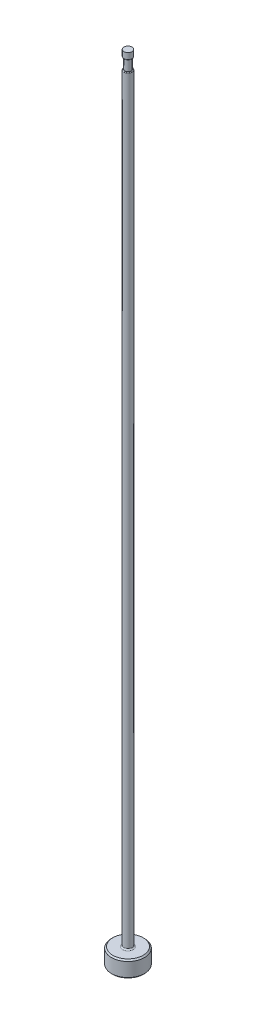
from build123d import *

# Parameters (mm, degrees)
CHAMFER1_SIZE     = 0.254
FILLET1_R         = 0.254
SKETCH2_W         = 0.2032
SKETCH2_H         = 2.032
D_SLOT_DEPTH      = 153.466131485
D_SLOT_DEPTH_BACK = 153.466131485
SKETCH5_W         = 0.0127
SKETCH5_H         = 1.27
FILLET2_R         = 0.127


with BuildPart() as part:
    # Sketch1 → Revolve1 (revolve)
    with BuildSketch(Plane.XY, mode=Mode.PRIVATE) as revolve1_sk:
        Polygon((0, 0), (-3.175, 0), (-3.175, 3.175), (-0.79375, 3.175), (-0.79375, 152.4), (0, 152.4), align=None)
    revolve(revolve1_sk.sketch.rotate(Axis((0, 259.958771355, 0), (0, -1, 0)), 270), axis=Axis((0, 259.958771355, 0), (0, -1, 0)))

    # Chamfer1
    chamfer1_edges = [part.edges().sort_by_distance(p)[0] for p in [
        (0, 3.175, -3.175),
        (0, 0, -3.175),
    ]]
    chamfer(chamfer1_edges, length=CHAMFER1_SIZE)

    # Fillet1
    fillet1_edges = [part.edges().sort_by_distance(p)[0] for p in [
        (0, 3.175, -0.79375),
    ]]
    fillet(fillet1_edges, radius=FILLET1_R)

    # Sketch2 → Vent Relief (revolve, cut)
    with BuildSketch(Plane.XY, mode=Mode.PRIVATE) as vent_relief_sk:
        with Locations((-0.69215, 150.114)):
            Rectangle(SKETCH2_W, SKETCH2_H)
    revolve(vent_relief_sk.sketch.rotate(Axis((0, 153.448281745, 0), (0, -1, 0)), 270), axis=Axis((0, 153.448281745, 0), (0, -1, 0)), mode=Mode.SUBTRACT)

    # Sketch3 → D-Slot (cut, two sides: drawn at the far end of the back side and taken through both)
    with BuildSketch(Plane.XY.offset(-D_SLOT_DEPTH_BACK)):
        with BuildLine():
            Line((-0.59055, 150.114), (-0.59055, 86.614))
            ThreePointArc((-0.59055, 86.614), (-0.641763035, 86.046038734), (-0.79375, 85.4964))
            Line((-0.79375, 85.4964), (-0.79375, 150.114))
            Line((-0.79375, 150.114), (-0.59055, 150.114))
        make_face()
    extrude(amount=D_SLOT_DEPTH + D_SLOT_DEPTH_BACK, mode=Mode.SUBTRACT)

    # Sketch5 → Vent Diameter (revolve, cut)
    with BuildSketch(Plane.XY, mode=Mode.PRIVATE) as vent_diameter_sk:
        with Locations((-0.7874, 151.765)):
            Rectangle(SKETCH5_W, SKETCH5_H)
    revolve(vent_diameter_sk.sketch.rotate(Axis((0, 152.687735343, 0), (0, -1, 0)), 90), axis=Axis((0, 152.687735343, 0), (0, -1, 0)), mode=Mode.SUBTRACT)

    # Fillet2
    fillet2_edges = [part.edges().sort_by_distance(p)[0] for p in [
        (0.724920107, 149.098, -0.323310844),
        (0, 151.13, 0.78105),
    ]]
    fillet(fillet2_edges, radius=FILLET2_R)


solid = part.part
